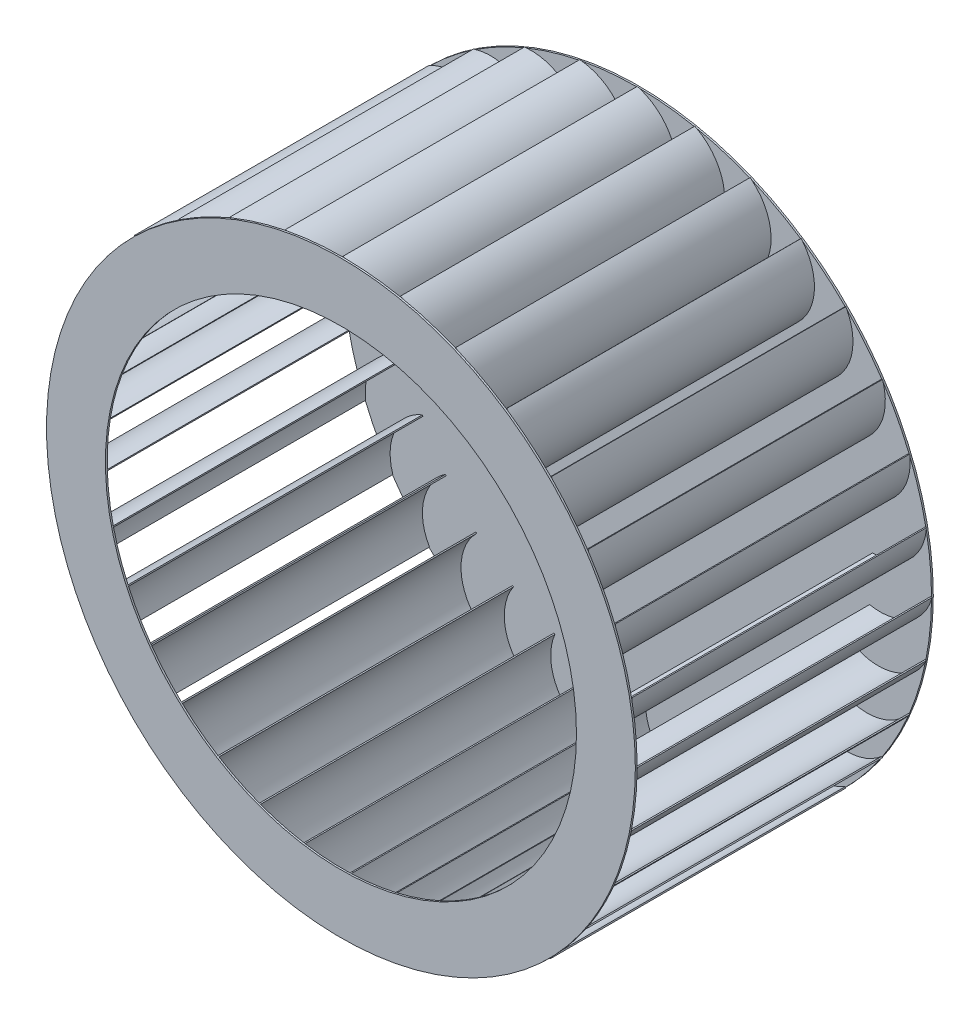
from build123d import *

# Parameters (mm, degrees)
SKETCH1_R         = 250
EXTRUDE1_DEPTH    = 1.5
EXTRUDE2_DEPTH    = 250
CIRPATTERN1_COUNT = 32
EXTRUDE3_START    = 1.5
SKETCH4_R         = 250
SKETCH4_R_2       = 200
EXTRUDE3_DEPTH    = 1.5


with BuildPart() as part:
    # Sketch1 → Extrude1 (new body)
    with BuildSketch(Plane.XY):
        Circle(SKETCH1_R)
    extrude(amount=-EXTRUDE1_DEPTH)

    # Sketch3 → Extrude2 (add)
    with BuildSketch(Plane.XY):
        with BuildLine():
            Line((31.913603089, 197.437387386), (32.892489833, 197.232984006))
            ThreePointArc((32.892489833, 197.232984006), (27.105589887, 230.376530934), (0.129409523, 250.482962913))
            Line((0.129409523, 250.482962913), (-0.129409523, 249.517037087))
            ThreePointArc((-0.129409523, 249.517037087), (26.253887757, 229.852504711), (31.913603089, 197.437387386))
        make_face()
    extrude2 = extrude(amount=EXTRUDE2_DEPTH)

    # CirPattern1: Extrude2 ×32 about axis
    cirpattern1_axis = Axis((0, 0, 0), (0, 0, 1))
    for i in range(1, CIRPATTERN1_COUNT):
        add(extrude2.rotate(cirpattern1_axis, i * 360 / CIRPATTERN1_COUNT))

    # Sketch4 → Extrude3 (add)
    with BuildSketch(Plane.XY.offset(250).offset(EXTRUDE3_START)):
        Circle(SKETCH4_R)
        with Locations(Location((0, 0, 0), (0, 0, 181.781437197))):
            Circle(SKETCH4_R_2, mode=Mode.SUBTRACT)
    extrude(amount=-EXTRUDE3_DEPTH)


solid = part.part
